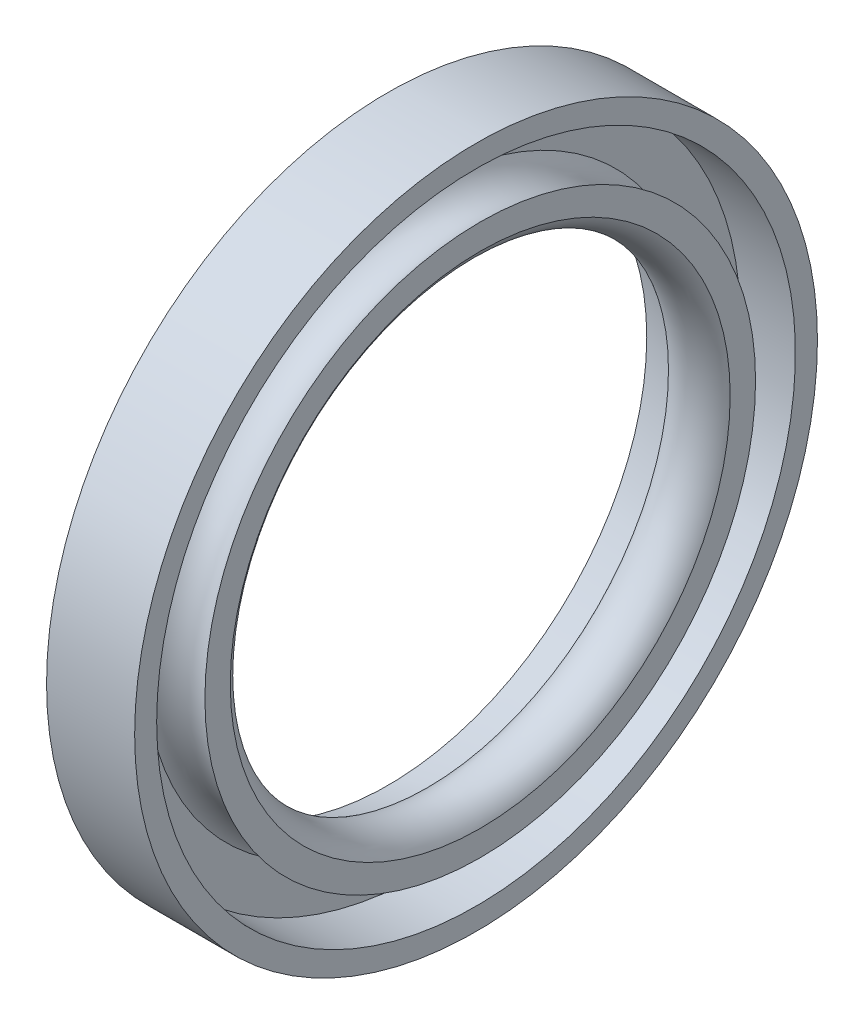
ISO-10303-21;
HEADER;
FILE_DESCRIPTION(('STEP AP214'),'2;1');
FILE_NAME('part.step','',(''),(''),'','','');
FILE_SCHEMA(('AUTOMOTIVE_DESIGN { 1 0 10303 214 1 1 1 1 }'));
ENDSEC;
DATA;
#1=APPLICATION_CONTEXT('core data for automotive mechanical design processes');
#2=APPLICATION_PROTOCOL_DEFINITION('international standard','automotive_design',2000,#1);
#3=PRODUCT_CONTEXT('',#1,'mechanical');
#4=PRODUCT('Part','Part','',(#3));
#5=PRODUCT_RELATED_PRODUCT_CATEGORY('part','',(#4));
#6=PRODUCT_DEFINITION_FORMATION('','',#4);
#7=PRODUCT_DEFINITION_CONTEXT('part definition',#1,'design');
#8=PRODUCT_DEFINITION('design','',#6,#7);
#9=PRODUCT_DEFINITION_SHAPE('','',#8);
#10=(LENGTH_UNIT() NAMED_UNIT(*) SI_UNIT(.MILLI.,.METRE.));
#11=(NAMED_UNIT(*) PLANE_ANGLE_UNIT() SI_UNIT($,.RADIAN.));
#12=(NAMED_UNIT(*) SI_UNIT($,.STERADIAN.) SOLID_ANGLE_UNIT());
#13=UNCERTAINTY_MEASURE_WITH_UNIT(LENGTH_MEASURE(1.E-05),#10,'distance_accuracy_value','');
#14=(GEOMETRIC_REPRESENTATION_CONTEXT(3) GLOBAL_UNCERTAINTY_ASSIGNED_CONTEXT((#13)) GLOBAL_UNIT_ASSIGNED_CONTEXT((#10,
#11,#12)) REPRESENTATION_CONTEXT('',''));
#15=CARTESIAN_POINT('',(0.,0.,0.));
#16=DIRECTION('',(0.,0.,1.));
#17=DIRECTION('',(1.,0.,0.));
#18=AXIS2_PLACEMENT_3D('',#15,#16,#17);
#19=CARTESIAN_POINT('',(-32.,29.,0.));
#20=DIRECTION('',(-1.,0.,0.));
#21=DIRECTION('',(0.,0.,1.));
#22=AXIS2_PLACEMENT_3D('',#19,#20,#21);
#23=PLANE('',#22);
#24=CARTESIAN_POINT('',(-32.,0.,0.));
#25=DIRECTION('',(-1.,0.,0.));
#26=DIRECTION('',(0.,0.,1.));
#27=AXIS2_PLACEMENT_3D('',#24,#25,#26);
#28=CIRCLE('',#27,31.);
#29=CARTESIAN_POINT('',(-32.,0.,31.));
#30=VERTEX_POINT('',#29);
#31=EDGE_CURVE('E46',#30,#30,#28,.T.);
#32=ORIENTED_EDGE('',*,*,#31,.F.);
#33=EDGE_LOOP('',(#32));
#34=FACE_BOUND('',#33,.T.);
#35=CARTESIAN_POINT('',(-32.,0.,0.));
#36=DIRECTION('',(-1.,0.,0.));
#37=DIRECTION('',(0.,0.,1.));
#38=AXIS2_PLACEMENT_3D('',#35,#36,#37);
#39=CIRCLE('',#38,29.);
#40=CARTESIAN_POINT('',(-32.,0.,29.));
#41=VERTEX_POINT('',#40);
#42=EDGE_CURVE('E10',#41,#41,#39,.T.);
#43=ORIENTED_EDGE('',*,*,#42,.T.);
#44=EDGE_LOOP('',(#43));
#45=FACE_BOUND('',#44,.T.);
#46=ADVANCED_FACE('F15',(#34,#45),#23,.F.);
#47=CARTESIAN_POINT('',(-120.,0.,0.));
#48=DIRECTION('',(-1.,0.,0.));
#49=DIRECTION('',(0.,0.,1.));
#50=AXIS2_PLACEMENT_3D('',#47,#48,#49);
#51=CYLINDRICAL_SURFACE('',#50,29.);
#52=ORIENTED_EDGE('',*,*,#42,.F.);
#53=EDGE_LOOP('',(#52));
#54=FACE_BOUND('',#53,.T.);
#55=CARTESIAN_POINT('',(-37.,0.,0.));
#56=DIRECTION('',(-1.,0.,0.));
#57=DIRECTION('',(0.,0.,1.));
#58=AXIS2_PLACEMENT_3D('',#55,#56,#57);
#59=CIRCLE('',#58,29.);
#60=CARTESIAN_POINT('',(-37.,0.,29.));
#61=VERTEX_POINT('',#60);
#62=EDGE_CURVE('E21',#61,#61,#59,.T.);
#63=ORIENTED_EDGE('',*,*,#62,.T.);
#64=EDGE_LOOP('',(#63));
#65=FACE_BOUND('',#64,.T.);
#66=ADVANCED_FACE('F53',(#54,#65),#51,.F.);
#67=CARTESIAN_POINT('',(-37.,25.,0.));
#68=DIRECTION('',(-1.,0.,0.));
#69=DIRECTION('',(0.,0.,1.));
#70=AXIS2_PLACEMENT_3D('',#67,#68,#69);
#71=PLANE('',#70);
#72=ORIENTED_EDGE('',*,*,#62,.F.);
#73=EDGE_LOOP('',(#72));
#74=FACE_BOUND('',#73,.T.);
#75=CARTESIAN_POINT('',(-37.,0.,0.));
#76=DIRECTION('',(-1.,0.,0.));
#77=DIRECTION('',(0.,0.,1.));
#78=AXIS2_PLACEMENT_3D('',#75,#76,#77);
#79=CIRCLE('',#78,25.);
#80=CARTESIAN_POINT('',(-37.,0.,25.));
#81=VERTEX_POINT('',#80);
#82=EDGE_CURVE('E25',#81,#81,#79,.T.);
#83=ORIENTED_EDGE('',*,*,#82,.T.);
#84=EDGE_LOOP('',(#83));
#85=FACE_BOUND('',#84,.T.);
#86=ADVANCED_FACE('F58',(#74,#85),#71,.F.);
#87=CARTESIAN_POINT('',(-34.3105288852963,0.,0.));
#88=DIRECTION('',(-1.,0.,0.));
#89=DIRECTION('',(0.,0.,1.));
#90=AXIS2_PLACEMENT_3D('',#87,#88,#89);
#91=TOROIDAL_SURFACE('',#90,26.3291896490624,3.);
#92=ORIENTED_EDGE('',*,*,#82,.F.);
#93=EDGE_LOOP('',(#92));
#94=FACE_BOUND('',#93,.T.);
#95=CARTESIAN_POINT('',(-31.6210577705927,0.,0.));
#96=DIRECTION('',(-1.,0.,0.));
#97=DIRECTION('',(0.,0.,1.));
#98=AXIS2_PLACEMENT_3D('',#95,#96,#97);
#99=CIRCLE('',#98,25.);
#100=CARTESIAN_POINT('',(-31.6210577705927,0.,25.));
#101=VERTEX_POINT('',#100);
#102=EDGE_CURVE('E29',#101,#101,#99,.T.);
#103=ORIENTED_EDGE('',*,*,#102,.T.);
#104=EDGE_LOOP('',(#103));
#105=FACE_BOUND('',#104,.T.);
#106=ADVANCED_FACE('F63',(#94,#105),#91,.F.);
#107=CARTESIAN_POINT('',(-31.6210577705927,22.6961524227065,0.));
#108=DIRECTION('',(-1.,0.,0.));
#109=DIRECTION('',(0.,0.,1.));
#110=AXIS2_PLACEMENT_3D('',#107,#108,#109);
#111=PLANE('',#110);
#112=ORIENTED_EDGE('',*,*,#102,.F.);
#113=EDGE_LOOP('',(#112));
#114=FACE_BOUND('',#113,.T.);
#115=CARTESIAN_POINT('',(-31.6210577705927,0.,0.));
#116=DIRECTION('',(-1.,0.,0.));
#117=DIRECTION('',(0.,0.,1.));
#118=AXIS2_PLACEMENT_3D('',#115,#116,#117);
#119=CIRCLE('',#118,22.6961524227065);
#120=CARTESIAN_POINT('',(-31.6210577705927,0.,22.6961524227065));
#121=VERTEX_POINT('',#120);
#122=EDGE_CURVE('E34',#121,#121,#119,.T.);
#123=ORIENTED_EDGE('',*,*,#122,.T.);
#124=EDGE_LOOP('',(#123));
#125=FACE_BOUND('',#124,.T.);
#126=ADVANCED_FACE('F69',(#114,#125),#111,.F.);
#127=CARTESIAN_POINT('',(-34.3105288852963,0.,0.));
#128=DIRECTION('',(-1.,0.,0.));
#129=DIRECTION('',(0.,0.,1.));
#130=AXIS2_PLACEMENT_3D('',#127,#128,#129);
#131=TOROIDAL_SURFACE('',#130,24.025342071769,3.);
#132=ORIENTED_EDGE('',*,*,#122,.F.);
#133=EDGE_LOOP('',(#132));
#134=FACE_BOUND('',#133,.T.);
#135=CARTESIAN_POINT('',(-37.,0.,0.));
#136=DIRECTION('',(-1.,0.,0.));
#137=DIRECTION('',(0.,0.,1.));
#138=AXIS2_PLACEMENT_3D('',#135,#136,#137);
#139=CIRCLE('',#138,22.6961524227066);
#140=CARTESIAN_POINT('',(-37.,0.,22.6961524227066));
#141=VERTEX_POINT('',#140);
#142=EDGE_CURVE('E37',#141,#141,#139,.T.);
#143=ORIENTED_EDGE('',*,*,#142,.T.);
#144=EDGE_LOOP('',(#143));
#145=FACE_BOUND('',#144,.T.);
#146=ADVANCED_FACE('F73',(#134,#145),#131,.T.);
#147=CARTESIAN_POINT('',(-40.,0.,0.));
#148=DIRECTION('',(-1.,0.,0.));
#149=DIRECTION('',(0.,0.,1.));
#150=AXIS2_PLACEMENT_3D('',#147,#148,#149);
#151=CONICAL_SURFACE('',#150,23.5,0.261799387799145);
#152=ORIENTED_EDGE('',*,*,#142,.F.);
#153=EDGE_LOOP('',(#152));
#154=FACE_BOUND('',#153,.T.);
#155=CARTESIAN_POINT('',(-40.,0.,0.));
#156=DIRECTION('',(-1.,0.,0.));
#157=DIRECTION('',(0.,0.,1.));
#158=AXIS2_PLACEMENT_3D('',#155,#156,#157);
#159=CIRCLE('',#158,23.5);
#160=CARTESIAN_POINT('',(-40.,0.,23.5));
#161=VERTEX_POINT('',#160);
#162=EDGE_CURVE('E40',#161,#161,#159,.T.);
#163=ORIENTED_EDGE('',*,*,#162,.T.);
#164=EDGE_LOOP('',(#163));
#165=FACE_BOUND('',#164,.T.);
#166=ADVANCED_FACE('F77',(#154,#165),#151,.F.);
#167=CARTESIAN_POINT('',(-40.,31.,0.));
#168=DIRECTION('',(1.,0.,0.));
#169=DIRECTION('',(0.,0.,-1.));
#170=AXIS2_PLACEMENT_3D('',#167,#168,#169);
#171=PLANE('',#170);
#172=ORIENTED_EDGE('',*,*,#162,.F.);
#173=EDGE_LOOP('',(#172));
#174=FACE_BOUND('',#173,.T.);
#175=CARTESIAN_POINT('',(-40.,0.,0.));
#176=DIRECTION('',(-1.,0.,0.));
#177=DIRECTION('',(0.,0.,1.));
#178=AXIS2_PLACEMENT_3D('',#175,#176,#177);
#179=CIRCLE('',#178,31.);
#180=CARTESIAN_POINT('',(-40.,0.,31.));
#181=VERTEX_POINT('',#180);
#182=EDGE_CURVE('E43',#181,#181,#179,.T.);
#183=ORIENTED_EDGE('',*,*,#182,.T.);
#184=EDGE_LOOP('',(#183));
#185=FACE_BOUND('',#184,.T.);
#186=ADVANCED_FACE('F81',(#174,#185),#171,.F.);
#187=CARTESIAN_POINT('',(-120.,0.,0.));
#188=DIRECTION('',(-1.,0.,0.));
#189=DIRECTION('',(0.,0.,1.));
#190=AXIS2_PLACEMENT_3D('',#187,#188,#189);
#191=CYLINDRICAL_SURFACE('',#190,31.);
#192=ORIENTED_EDGE('',*,*,#182,.F.);
#193=EDGE_LOOP('',(#192));
#194=FACE_BOUND('',#193,.T.);
#195=ORIENTED_EDGE('',*,*,#31,.T.);
#196=EDGE_LOOP('',(#195));
#197=FACE_BOUND('',#196,.T.);
#198=ADVANCED_FACE('F50',(#194,#197),#191,.T.);
#199=CLOSED_SHELL('',(#46,#66,#86,#106,#126,#146,#166,#186,#198));
#200=MANIFOLD_SOLID_BREP('B1',#199);
#201=ADVANCED_BREP_SHAPE_REPRESENTATION('',(#18,#200),#14);
#202=SHAPE_DEFINITION_REPRESENTATION(#9,#201);
ENDSEC;
END-ISO-10303-21;
